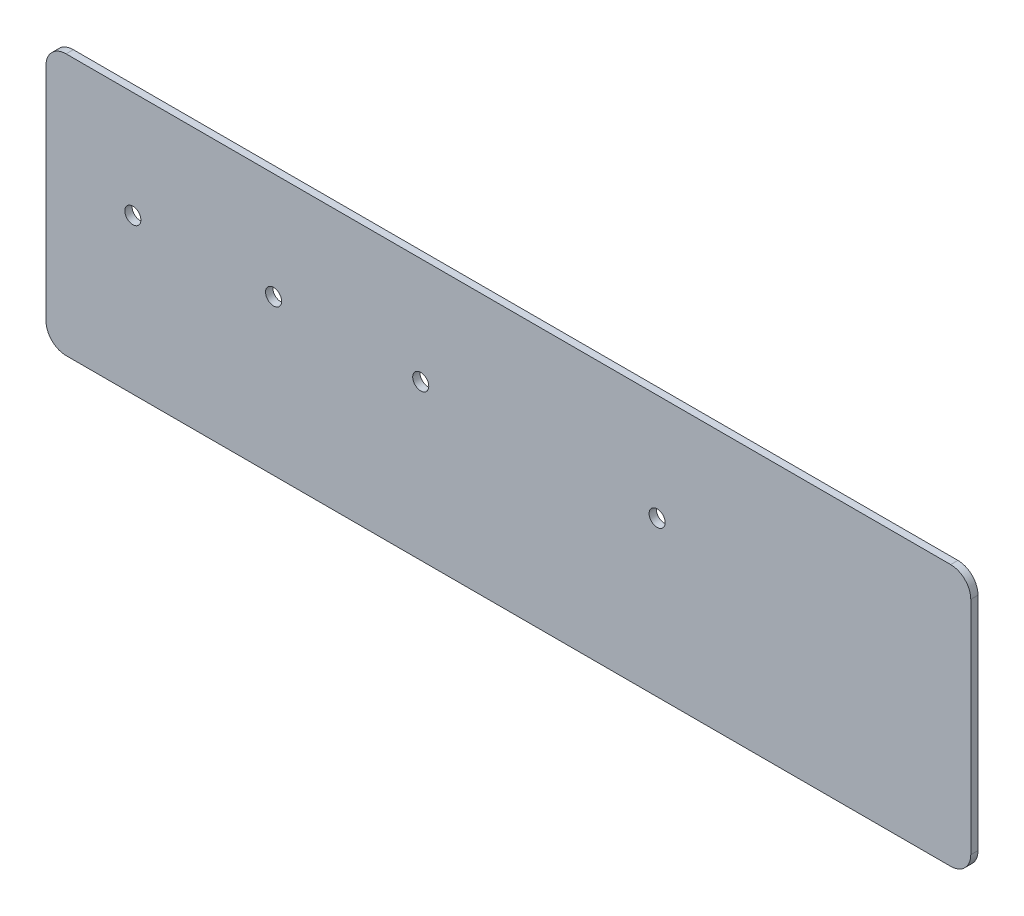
ISO-10303-21;
HEADER;
FILE_DESCRIPTION(('STEP AP214'),'2;1');
FILE_NAME('part.step','',(''),(''),'','','');
FILE_SCHEMA(('AUTOMOTIVE_DESIGN { 1 0 10303 214 1 1 1 1 }'));
ENDSEC;
DATA;
#1=APPLICATION_CONTEXT('core data for automotive mechanical design processes');
#2=APPLICATION_PROTOCOL_DEFINITION('international standard','automotive_design',2000,#1);
#3=PRODUCT_CONTEXT('',#1,'mechanical');
#4=PRODUCT('Part','Part','',(#3));
#5=PRODUCT_RELATED_PRODUCT_CATEGORY('part','',(#4));
#6=PRODUCT_DEFINITION_FORMATION('','',#4);
#7=PRODUCT_DEFINITION_CONTEXT('part definition',#1,'design');
#8=PRODUCT_DEFINITION('design','',#6,#7);
#9=PRODUCT_DEFINITION_SHAPE('','',#8);
#10=(LENGTH_UNIT() NAMED_UNIT(*) SI_UNIT(.MILLI.,.METRE.));
#11=(NAMED_UNIT(*) PLANE_ANGLE_UNIT() SI_UNIT($,.RADIAN.));
#12=(NAMED_UNIT(*) SI_UNIT($,.STERADIAN.) SOLID_ANGLE_UNIT());
#13=UNCERTAINTY_MEASURE_WITH_UNIT(LENGTH_MEASURE(1.E-05),#10,'distance_accuracy_value','');
#14=(GEOMETRIC_REPRESENTATION_CONTEXT(3) GLOBAL_UNCERTAINTY_ASSIGNED_CONTEXT((#13)) GLOBAL_UNIT_ASSIGNED_CONTEXT((#10,
#11,#12)) REPRESENTATION_CONTEXT('',''));
#15=CARTESIAN_POINT('',(0.,0.,0.));
#16=DIRECTION('',(0.,0.,1.));
#17=DIRECTION('',(1.,0.,0.));
#18=AXIS2_PLACEMENT_3D('',#15,#16,#17);
#19=CARTESIAN_POINT('',(0.,0.,-2.286));
#20=DIRECTION('',(-1.,0.,0.));
#21=DIRECTION('',(0.,0.,1.));
#22=AXIS2_PLACEMENT_3D('',#19,#20,#21);
#23=PLANE('',#22);
#24=DIRECTION('',(0.,-1.,0.));
#25=VECTOR('',#24,1.);
#26=CARTESIAN_POINT('',(0.,0.,-2.286));
#27=LINE('',#26,#25);
#28=CARTESIAN_POINT('',(0.,76.2,-2.286));
#29=VERTEX_POINT('',#28);
#30=CARTESIAN_POINT('',(0.,6.35,-2.286));
#31=VERTEX_POINT('',#30);
#32=EDGE_CURVE('E169',#29,#31,#27,.T.);
#33=ORIENTED_EDGE('',*,*,#32,.T.);
#34=DIRECTION('',(0.,0.,1.));
#35=VECTOR('',#34,1.);
#36=CARTESIAN_POINT('',(0.,6.35,-2.286));
#37=LINE('',#36,#35);
#38=CARTESIAN_POINT('',(0.,6.35,0.));
#39=VERTEX_POINT('',#38);
#40=EDGE_CURVE('E123',#31,#39,#37,.T.);
#41=ORIENTED_EDGE('',*,*,#40,.T.);
#42=DIRECTION('',(0.,-1.,0.));
#43=VECTOR('',#42,1.);
#44=CARTESIAN_POINT('',(0.,0.,0.));
#45=LINE('',#44,#43);
#46=CARTESIAN_POINT('',(0.,76.2,0.));
#47=VERTEX_POINT('',#46);
#48=EDGE_CURVE('E107',#47,#39,#45,.T.);
#49=ORIENTED_EDGE('',*,*,#48,.F.);
#50=DIRECTION('',(0.,0.,1.));
#51=VECTOR('',#50,1.);
#52=CARTESIAN_POINT('',(0.,76.2,-2.286));
#53=LINE('',#52,#51);
#54=EDGE_CURVE('E120',#47,#29,#53,.F.);
#55=ORIENTED_EDGE('',*,*,#54,.T.);
#56=EDGE_LOOP('',(#33,#41,#49,#55));
#57=FACE_BOUND('',#56,.T.);
#58=ADVANCED_FACE('F38',(#57),#23,.T.);
#59=CARTESIAN_POINT('',(0.,82.55,-2.286));
#60=DIRECTION('',(0.,1.,0.));
#61=DIRECTION('',(0.,0.,1.));
#62=AXIS2_PLACEMENT_3D('',#59,#60,#61);
#63=PLANE('',#62);
#64=DIRECTION('',(-1.,0.,0.));
#65=VECTOR('',#64,1.);
#66=CARTESIAN_POINT('',(0.,82.55,-2.286));
#67=LINE('',#66,#65);
#68=CARTESIAN_POINT('',(285.75,82.55,-2.286));
#69=VERTEX_POINT('',#68);
#70=CARTESIAN_POINT('',(6.35,82.55,-2.286));
#71=VERTEX_POINT('',#70);
#72=EDGE_CURVE('E130',#69,#71,#67,.T.);
#73=ORIENTED_EDGE('',*,*,#72,.T.);
#74=DIRECTION('',(0.,0.,1.));
#75=VECTOR('',#74,1.);
#76=CARTESIAN_POINT('',(6.35,82.55,-2.286));
#77=LINE('',#76,#75);
#78=CARTESIAN_POINT('',(6.35,82.55,0.));
#79=VERTEX_POINT('',#78);
#80=EDGE_CURVE('E156',#71,#79,#77,.T.);
#81=ORIENTED_EDGE('',*,*,#80,.T.);
#82=DIRECTION('',(-1.,0.,0.));
#83=VECTOR('',#82,1.);
#84=CARTESIAN_POINT('',(0.,82.55,0.));
#85=LINE('',#84,#83);
#86=CARTESIAN_POINT('',(285.75,82.55,0.));
#87=VERTEX_POINT('',#86);
#88=EDGE_CURVE('E109',#87,#79,#85,.T.);
#89=ORIENTED_EDGE('',*,*,#88,.F.);
#90=DIRECTION('',(0.,0.,1.));
#91=VECTOR('',#90,1.);
#92=CARTESIAN_POINT('',(285.75,82.55,-2.286));
#93=LINE('',#92,#91);
#94=EDGE_CURVE('E154',#87,#69,#93,.F.);
#95=ORIENTED_EDGE('',*,*,#94,.T.);
#96=EDGE_LOOP('',(#73,#81,#89,#95));
#97=FACE_BOUND('',#96,.T.);
#98=ADVANCED_FACE('F158',(#97),#63,.T.);
#99=CARTESIAN_POINT('',(292.1,0.,-2.286));
#100=DIRECTION('',(1.,0.,0.));
#101=DIRECTION('',(0.,0.,-1.));
#102=AXIS2_PLACEMENT_3D('',#99,#100,#101);
#103=PLANE('',#102);
#104=DIRECTION('',(0.,1.,0.));
#105=VECTOR('',#104,1.);
#106=CARTESIAN_POINT('',(292.1,0.,-2.286));
#107=LINE('',#106,#105);
#108=CARTESIAN_POINT('',(292.1,6.35,-2.286));
#109=VERTEX_POINT('',#108);
#110=CARTESIAN_POINT('',(292.1,76.2,-2.286));
#111=VERTEX_POINT('',#110);
#112=EDGE_CURVE('E135',#109,#111,#107,.T.);
#113=ORIENTED_EDGE('',*,*,#112,.T.);
#114=DIRECTION('',(0.,0.,1.));
#115=VECTOR('',#114,1.);
#116=CARTESIAN_POINT('',(292.1,76.2,-2.286));
#117=LINE('',#116,#115);
#118=CARTESIAN_POINT('',(292.1,76.2,0.));
#119=VERTEX_POINT('',#118);
#120=EDGE_CURVE('E11',#111,#119,#117,.T.);
#121=ORIENTED_EDGE('',*,*,#120,.T.);
#122=DIRECTION('',(0.,1.,0.));
#123=VECTOR('',#122,1.);
#124=CARTESIAN_POINT('',(292.1,0.,0.));
#125=LINE('',#124,#123);
#126=CARTESIAN_POINT('',(292.1,6.35,0.));
#127=VERTEX_POINT('',#126);
#128=EDGE_CURVE('E167',#127,#119,#125,.T.);
#129=ORIENTED_EDGE('',*,*,#128,.F.);
#130=DIRECTION('',(0.,0.,1.));
#131=VECTOR('',#130,1.);
#132=CARTESIAN_POINT('',(292.1,6.35,-2.286));
#133=LINE('',#132,#131);
#134=EDGE_CURVE('E46',#127,#109,#133,.F.);
#135=ORIENTED_EDGE('',*,*,#134,.T.);
#136=EDGE_LOOP('',(#113,#121,#129,#135));
#137=FACE_BOUND('',#136,.T.);
#138=ADVANCED_FACE('F166',(#137),#103,.T.);
#139=CARTESIAN_POINT('',(0.,0.,-2.286));
#140=DIRECTION('',(0.,-1.,0.));
#141=DIRECTION('',(0.,0.,-1.));
#142=AXIS2_PLACEMENT_3D('',#139,#140,#141);
#143=PLANE('',#142);
#144=DIRECTION('',(1.,0.,0.));
#145=VECTOR('',#144,1.);
#146=CARTESIAN_POINT('',(0.,0.,0.));
#147=LINE('',#146,#145);
#148=CARTESIAN_POINT('',(6.35,0.,0.));
#149=VERTEX_POINT('',#148);
#150=CARTESIAN_POINT('',(285.75,0.,0.));
#151=VERTEX_POINT('',#150);
#152=EDGE_CURVE('E124',#149,#151,#147,.T.);
#153=ORIENTED_EDGE('',*,*,#152,.F.);
#154=DIRECTION('',(0.,0.,1.));
#155=VECTOR('',#154,1.);
#156=CARTESIAN_POINT('',(6.35,0.,-2.286));
#157=LINE('',#156,#155);
#158=CARTESIAN_POINT('',(6.35,0.,-2.286));
#159=VERTEX_POINT('',#158);
#160=EDGE_CURVE('E146',#149,#159,#157,.F.);
#161=ORIENTED_EDGE('',*,*,#160,.T.);
#162=DIRECTION('',(1.,0.,0.));
#163=VECTOR('',#162,1.);
#164=CARTESIAN_POINT('',(0.,0.,-2.286));
#165=LINE('',#164,#163);
#166=CARTESIAN_POINT('',(285.75,0.,-2.286));
#167=VERTEX_POINT('',#166);
#168=EDGE_CURVE('E173',#159,#167,#165,.T.);
#169=ORIENTED_EDGE('',*,*,#168,.T.);
#170=DIRECTION('',(0.,0.,1.));
#171=VECTOR('',#170,1.);
#172=CARTESIAN_POINT('',(285.75,0.,-2.286));
#173=LINE('',#172,#171);
#174=EDGE_CURVE('E143',#167,#151,#173,.T.);
#175=ORIENTED_EDGE('',*,*,#174,.T.);
#176=EDGE_LOOP('',(#153,#161,#169,#175));
#177=FACE_BOUND('',#176,.T.);
#178=ADVANCED_FACE('F240',(#177),#143,.T.);
#179=CARTESIAN_POINT('',(0.,0.,-2.286));
#180=DIRECTION('',(0.,0.,-1.));
#181=DIRECTION('',(-1.,0.,0.));
#182=AXIS2_PLACEMENT_3D('',#179,#180,#181);
#183=PLANE('',#182);
#184=CARTESIAN_POINT('',(193.04,48.895,-2.286));
#185=DIRECTION('',(0.,0.,1.));
#186=DIRECTION('',(1.,0.,0.));
#187=AXIS2_PLACEMENT_3D('',#184,#185,#186);
#188=CIRCLE('',#187,2.54000000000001);
#189=CARTESIAN_POINT('',(195.58,48.895,-2.286));
#190=VERTEX_POINT('',#189);
#191=EDGE_CURVE('E192',#190,#190,#188,.T.);
#192=ORIENTED_EDGE('',*,*,#191,.T.);
#193=EDGE_LOOP('',(#192));
#194=FACE_BOUND('',#193,.T.);
#195=CARTESIAN_POINT('',(118.364,48.895,-2.286));
#196=DIRECTION('',(0.,0.,1.));
#197=DIRECTION('',(1.,0.,0.));
#198=AXIS2_PLACEMENT_3D('',#195,#196,#197);
#199=CIRCLE('',#198,2.53999999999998);
#200=CARTESIAN_POINT('',(120.904,48.895,-2.286));
#201=VERTEX_POINT('',#200);
#202=EDGE_CURVE('E186',#201,#201,#199,.T.);
#203=ORIENTED_EDGE('',*,*,#202,.T.);
#204=EDGE_LOOP('',(#203));
#205=FACE_BOUND('',#204,.T.);
#206=CARTESIAN_POINT('',(71.882,48.895,-2.286));
#207=DIRECTION('',(0.,0.,1.));
#208=DIRECTION('',(1.,0.,0.));
#209=AXIS2_PLACEMENT_3D('',#206,#207,#208);
#210=CIRCLE('',#209,2.54);
#211=CARTESIAN_POINT('',(74.422,48.895,-2.286));
#212=VERTEX_POINT('',#211);
#213=EDGE_CURVE('E180',#212,#212,#210,.T.);
#214=ORIENTED_EDGE('',*,*,#213,.T.);
#215=EDGE_LOOP('',(#214));
#216=FACE_BOUND('',#215,.T.);
#217=CARTESIAN_POINT('',(27.432,48.895,-2.286));
#218=DIRECTION('',(0.,0.,1.));
#219=DIRECTION('',(1.,0.,0.));
#220=AXIS2_PLACEMENT_3D('',#217,#218,#219);
#221=CIRCLE('',#220,2.54);
#222=CARTESIAN_POINT('',(29.972,48.895,-2.286));
#223=VERTEX_POINT('',#222);
#224=EDGE_CURVE('E125',#223,#223,#221,.T.);
#225=ORIENTED_EDGE('',*,*,#224,.T.);
#226=EDGE_LOOP('',(#225));
#227=FACE_BOUND('',#226,.T.);
#228=ORIENTED_EDGE('',*,*,#168,.F.);
#229=CARTESIAN_POINT('',(6.35,6.35,-2.286));
#230=DIRECTION('',(0.,0.,-1.));
#231=DIRECTION('',(-1.,0.,0.));
#232=AXIS2_PLACEMENT_3D('',#229,#230,#231);
#233=CIRCLE('',#232,6.35);
#234=EDGE_CURVE('E152',#159,#31,#233,.T.);
#235=ORIENTED_EDGE('',*,*,#234,.T.);
#236=ORIENTED_EDGE('',*,*,#32,.F.);
#237=CARTESIAN_POINT('',(6.35,76.2,-2.286));
#238=DIRECTION('',(0.,0.,-1.));
#239=DIRECTION('',(-1.,0.,0.));
#240=AXIS2_PLACEMENT_3D('',#237,#238,#239);
#241=CIRCLE('',#240,6.35);
#242=EDGE_CURVE('E129',#29,#71,#241,.T.);
#243=ORIENTED_EDGE('',*,*,#242,.T.);
#244=ORIENTED_EDGE('',*,*,#72,.F.);
#245=CARTESIAN_POINT('',(285.75,76.2,-2.286));
#246=DIRECTION('',(0.,0.,-1.));
#247=DIRECTION('',(-1.,0.,0.));
#248=AXIS2_PLACEMENT_3D('',#245,#246,#247);
#249=CIRCLE('',#248,6.35);
#250=EDGE_CURVE('E53',#69,#111,#249,.T.);
#251=ORIENTED_EDGE('',*,*,#250,.T.);
#252=ORIENTED_EDGE('',*,*,#112,.F.);
#253=CARTESIAN_POINT('',(285.75,6.35,-2.286));
#254=DIRECTION('',(0.,0.,-1.));
#255=DIRECTION('',(-1.,0.,0.));
#256=AXIS2_PLACEMENT_3D('',#253,#254,#255);
#257=CIRCLE('',#256,6.35);
#258=EDGE_CURVE('E148',#109,#167,#257,.T.);
#259=ORIENTED_EDGE('',*,*,#258,.T.);
#260=EDGE_LOOP('',(#228,#235,#236,#243,#244,#251,#252,#259));
#261=FACE_BOUND('',#260,.T.);
#262=ADVANCED_FACE('F161',(#194,#205,#216,#227,#261),#183,.T.);
#263=CARTESIAN_POINT('',(0.,0.,0.));
#264=DIRECTION('',(0.,0.,-1.));
#265=DIRECTION('',(-1.,0.,0.));
#266=AXIS2_PLACEMENT_3D('',#263,#264,#265);
#267=PLANE('',#266);
#268=CARTESIAN_POINT('',(193.04,48.895,0.));
#269=DIRECTION('',(0.,0.,1.));
#270=DIRECTION('',(1.,0.,0.));
#271=AXIS2_PLACEMENT_3D('',#268,#269,#270);
#272=CIRCLE('',#271,2.54000000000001);
#273=CARTESIAN_POINT('',(195.58,48.895,0.));
#274=VERTEX_POINT('',#273);
#275=EDGE_CURVE('E195',#274,#274,#272,.T.);
#276=ORIENTED_EDGE('',*,*,#275,.F.);
#277=EDGE_LOOP('',(#276));
#278=FACE_BOUND('',#277,.T.);
#279=CARTESIAN_POINT('',(118.364,48.895,0.));
#280=DIRECTION('',(0.,0.,1.));
#281=DIRECTION('',(1.,0.,0.));
#282=AXIS2_PLACEMENT_3D('',#279,#280,#281);
#283=CIRCLE('',#282,2.53999999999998);
#284=CARTESIAN_POINT('',(120.904,48.895,0.));
#285=VERTEX_POINT('',#284);
#286=EDGE_CURVE('E189',#285,#285,#283,.T.);
#287=ORIENTED_EDGE('',*,*,#286,.F.);
#288=EDGE_LOOP('',(#287));
#289=FACE_BOUND('',#288,.T.);
#290=CARTESIAN_POINT('',(71.882,48.895,0.));
#291=DIRECTION('',(0.,0.,1.));
#292=DIRECTION('',(1.,0.,0.));
#293=AXIS2_PLACEMENT_3D('',#290,#291,#292);
#294=CIRCLE('',#293,2.54);
#295=CARTESIAN_POINT('',(74.422,48.895,0.));
#296=VERTEX_POINT('',#295);
#297=EDGE_CURVE('E183',#296,#296,#294,.T.);
#298=ORIENTED_EDGE('',*,*,#297,.F.);
#299=EDGE_LOOP('',(#298));
#300=FACE_BOUND('',#299,.T.);
#301=CARTESIAN_POINT('',(27.432,48.895,0.));
#302=DIRECTION('',(0.,0.,1.));
#303=DIRECTION('',(1.,0.,0.));
#304=AXIS2_PLACEMENT_3D('',#301,#302,#303);
#305=CIRCLE('',#304,2.54);
#306=CARTESIAN_POINT('',(29.972,48.895,0.));
#307=VERTEX_POINT('',#306);
#308=EDGE_CURVE('E177',#307,#307,#305,.T.);
#309=ORIENTED_EDGE('',*,*,#308,.F.);
#310=EDGE_LOOP('',(#309));
#311=FACE_BOUND('',#310,.T.);
#312=ORIENTED_EDGE('',*,*,#48,.T.);
#313=CARTESIAN_POINT('',(6.35,6.35,0.));
#314=DIRECTION('',(0.,0.,-1.));
#315=DIRECTION('',(-1.,0.,0.));
#316=AXIS2_PLACEMENT_3D('',#313,#314,#315);
#317=CIRCLE('',#316,6.35);
#318=EDGE_CURVE('E114',#39,#149,#317,.F.);
#319=ORIENTED_EDGE('',*,*,#318,.T.);
#320=ORIENTED_EDGE('',*,*,#152,.T.);
#321=CARTESIAN_POINT('',(285.75,6.35,0.));
#322=DIRECTION('',(0.,0.,-1.));
#323=DIRECTION('',(-1.,0.,0.));
#324=AXIS2_PLACEMENT_3D('',#321,#322,#323);
#325=CIRCLE('',#324,6.35);
#326=EDGE_CURVE('E132',#151,#127,#325,.F.);
#327=ORIENTED_EDGE('',*,*,#326,.T.);
#328=ORIENTED_EDGE('',*,*,#128,.T.);
#329=CARTESIAN_POINT('',(285.75,76.2,0.));
#330=DIRECTION('',(0.,0.,-1.));
#331=DIRECTION('',(-1.,0.,0.));
#332=AXIS2_PLACEMENT_3D('',#329,#330,#331);
#333=CIRCLE('',#332,6.35);
#334=EDGE_CURVE('E115',#119,#87,#333,.F.);
#335=ORIENTED_EDGE('',*,*,#334,.T.);
#336=ORIENTED_EDGE('',*,*,#88,.T.);
#337=CARTESIAN_POINT('',(6.35,76.2,0.));
#338=DIRECTION('',(0.,0.,-1.));
#339=DIRECTION('',(-1.,0.,0.));
#340=AXIS2_PLACEMENT_3D('',#337,#338,#339);
#341=CIRCLE('',#340,6.35);
#342=EDGE_CURVE('E104',#79,#47,#341,.F.);
#343=ORIENTED_EDGE('',*,*,#342,.T.);
#344=EDGE_LOOP('',(#312,#319,#320,#327,#328,#335,#336,#343));
#345=FACE_BOUND('',#344,.T.);
#346=ADVANCED_FACE('F106',(#278,#289,#300,#311,#345),#267,.F.);
#347=CARTESIAN_POINT('',(27.432,48.895,-2.286));
#348=DIRECTION('',(0.,0.,1.));
#349=DIRECTION('',(1.,0.,0.));
#350=AXIS2_PLACEMENT_3D('',#347,#348,#349);
#351=CYLINDRICAL_SURFACE('',#350,2.54);
#352=ORIENTED_EDGE('',*,*,#224,.F.);
#353=EDGE_LOOP('',(#352));
#354=FACE_BOUND('',#353,.T.);
#355=ORIENTED_EDGE('',*,*,#308,.T.);
#356=EDGE_LOOP('',(#355));
#357=FACE_BOUND('',#356,.T.);
#358=ADVANCED_FACE('F213',(#354,#357),#351,.F.);
#359=CARTESIAN_POINT('',(71.882,48.895,-2.286));
#360=DIRECTION('',(0.,0.,1.));
#361=DIRECTION('',(1.,0.,0.));
#362=AXIS2_PLACEMENT_3D('',#359,#360,#361);
#363=CYLINDRICAL_SURFACE('',#362,2.54);
#364=ORIENTED_EDGE('',*,*,#213,.F.);
#365=EDGE_LOOP('',(#364));
#366=FACE_BOUND('',#365,.T.);
#367=ORIENTED_EDGE('',*,*,#297,.T.);
#368=EDGE_LOOP('',(#367));
#369=FACE_BOUND('',#368,.T.);
#370=ADVANCED_FACE('F222',(#366,#369),#363,.F.);
#371=CARTESIAN_POINT('',(118.364,48.895,-2.286));
#372=DIRECTION('',(0.,0.,1.));
#373=DIRECTION('',(1.,0.,0.));
#374=AXIS2_PLACEMENT_3D('',#371,#372,#373);
#375=CYLINDRICAL_SURFACE('',#374,2.53999999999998);
#376=ORIENTED_EDGE('',*,*,#202,.F.);
#377=EDGE_LOOP('',(#376));
#378=FACE_BOUND('',#377,.T.);
#379=ORIENTED_EDGE('',*,*,#286,.T.);
#380=EDGE_LOOP('',(#379));
#381=FACE_BOUND('',#380,.T.);
#382=ADVANCED_FACE('F207',(#378,#381),#375,.F.);
#383=CARTESIAN_POINT('',(193.04,48.895,-2.286));
#384=DIRECTION('',(0.,0.,1.));
#385=DIRECTION('',(1.,0.,0.));
#386=AXIS2_PLACEMENT_3D('',#383,#384,#385);
#387=CYLINDRICAL_SURFACE('',#386,2.54000000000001);
#388=ORIENTED_EDGE('',*,*,#191,.F.);
#389=EDGE_LOOP('',(#388));
#390=FACE_BOUND('',#389,.T.);
#391=ORIENTED_EDGE('',*,*,#275,.T.);
#392=EDGE_LOOP('',(#391));
#393=FACE_BOUND('',#392,.T.);
#394=ADVANCED_FACE('F203',(#390,#393),#387,.F.);
#395=CARTESIAN_POINT('',(6.35,6.35,-2.286));
#396=DIRECTION('',(0.,0.,1.));
#397=DIRECTION('',(1.,0.,0.));
#398=AXIS2_PLACEMENT_3D('',#395,#396,#397);
#399=CYLINDRICAL_SURFACE('',#398,6.35);
#400=ORIENTED_EDGE('',*,*,#234,.F.);
#401=ORIENTED_EDGE('',*,*,#160,.F.);
#402=ORIENTED_EDGE('',*,*,#318,.F.);
#403=ORIENTED_EDGE('',*,*,#40,.F.);
#404=EDGE_LOOP('',(#400,#401,#402,#403));
#405=FACE_BOUND('',#404,.T.);
#406=ADVANCED_FACE('F206',(#405),#399,.T.);
#407=CARTESIAN_POINT('',(6.35,76.2,-2.286));
#408=DIRECTION('',(0.,0.,1.));
#409=DIRECTION('',(1.,0.,0.));
#410=AXIS2_PLACEMENT_3D('',#407,#408,#409);
#411=CYLINDRICAL_SURFACE('',#410,6.35);
#412=ORIENTED_EDGE('',*,*,#242,.F.);
#413=ORIENTED_EDGE('',*,*,#54,.F.);
#414=ORIENTED_EDGE('',*,*,#342,.F.);
#415=ORIENTED_EDGE('',*,*,#80,.F.);
#416=EDGE_LOOP('',(#412,#413,#414,#415));
#417=FACE_BOUND('',#416,.T.);
#418=ADVANCED_FACE('F128',(#417),#411,.T.);
#419=CARTESIAN_POINT('',(285.75,76.2,-2.286));
#420=DIRECTION('',(0.,0.,1.));
#421=DIRECTION('',(1.,0.,0.));
#422=AXIS2_PLACEMENT_3D('',#419,#420,#421);
#423=CYLINDRICAL_SURFACE('',#422,6.35);
#424=ORIENTED_EDGE('',*,*,#250,.F.);
#425=ORIENTED_EDGE('',*,*,#94,.F.);
#426=ORIENTED_EDGE('',*,*,#334,.F.);
#427=ORIENTED_EDGE('',*,*,#120,.F.);
#428=EDGE_LOOP('',(#424,#425,#426,#427));
#429=FACE_BOUND('',#428,.T.);
#430=ADVANCED_FACE('F164',(#429),#423,.T.);
#431=CARTESIAN_POINT('',(285.75,6.35,-2.286));
#432=DIRECTION('',(0.,0.,1.));
#433=DIRECTION('',(1.,0.,0.));
#434=AXIS2_PLACEMENT_3D('',#431,#432,#433);
#435=CYLINDRICAL_SURFACE('',#434,6.35);
#436=ORIENTED_EDGE('',*,*,#258,.F.);
#437=ORIENTED_EDGE('',*,*,#134,.F.);
#438=ORIENTED_EDGE('',*,*,#326,.F.);
#439=ORIENTED_EDGE('',*,*,#174,.F.);
#440=EDGE_LOOP('',(#436,#437,#438,#439));
#441=FACE_BOUND('',#440,.T.);
#442=ADVANCED_FACE('F40',(#441),#435,.T.);
#443=CLOSED_SHELL('',(#58,#98,#138,#178,#262,#346,#358,#370,#382,#394,#406,#418,#430,#442));
#444=MANIFOLD_SOLID_BREP('B2',#443);
#445=ADVANCED_BREP_SHAPE_REPRESENTATION('',(#18,#444),#14);
#446=SHAPE_DEFINITION_REPRESENTATION(#9,#445);
ENDSEC;
END-ISO-10303-21;
